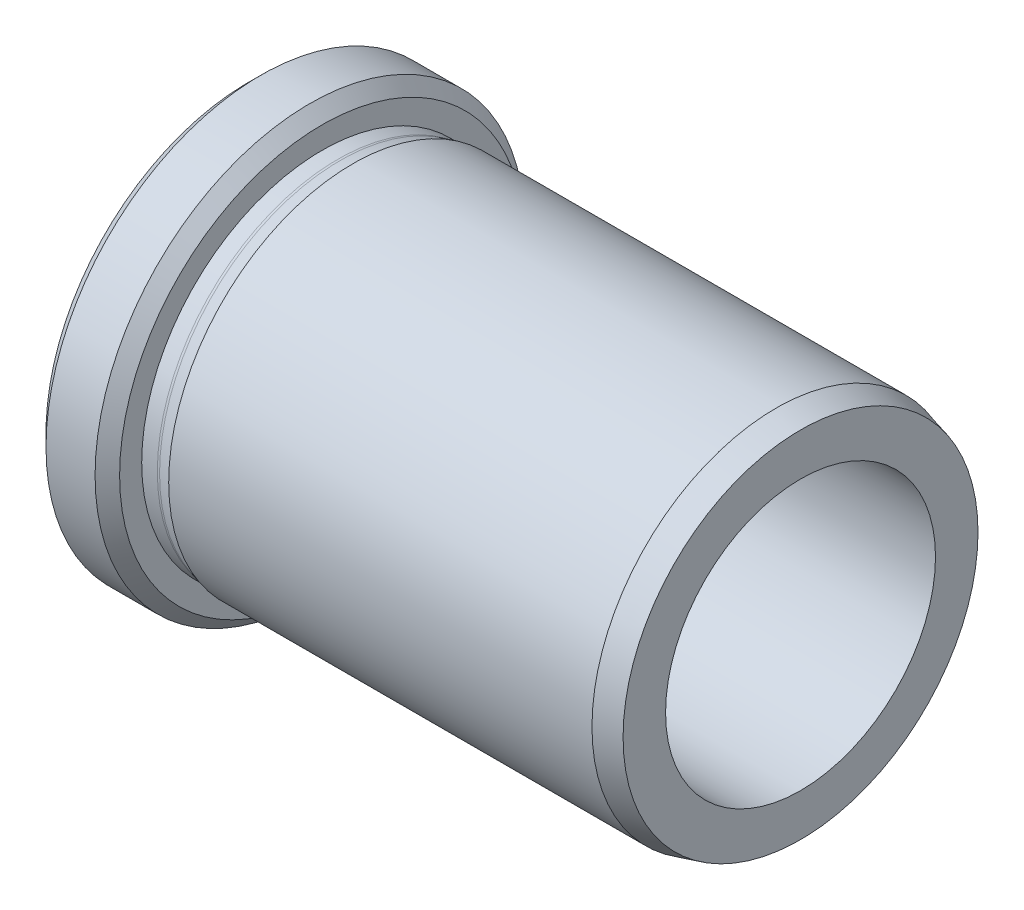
ISO-10303-21;
HEADER;
FILE_DESCRIPTION(('STEP AP214'),'2;1');
FILE_NAME('part.step','',(''),(''),'','','');
FILE_SCHEMA(('AUTOMOTIVE_DESIGN { 1 0 10303 214 1 1 1 1 }'));
ENDSEC;
DATA;
#1=APPLICATION_CONTEXT('core data for automotive mechanical design processes');
#2=APPLICATION_PROTOCOL_DEFINITION('international standard','automotive_design',2000,#1);
#3=PRODUCT_CONTEXT('',#1,'mechanical');
#4=PRODUCT('Part','Part','',(#3));
#5=PRODUCT_RELATED_PRODUCT_CATEGORY('part','',(#4));
#6=PRODUCT_DEFINITION_FORMATION('','',#4);
#7=PRODUCT_DEFINITION_CONTEXT('part definition',#1,'design');
#8=PRODUCT_DEFINITION('design','',#6,#7);
#9=PRODUCT_DEFINITION_SHAPE('','',#8);
#10=(LENGTH_UNIT() NAMED_UNIT(*) SI_UNIT(.MILLI.,.METRE.));
#11=(NAMED_UNIT(*) PLANE_ANGLE_UNIT() SI_UNIT($,.RADIAN.));
#12=(NAMED_UNIT(*) SI_UNIT($,.STERADIAN.) SOLID_ANGLE_UNIT());
#13=UNCERTAINTY_MEASURE_WITH_UNIT(LENGTH_MEASURE(1.E-05),#10,'distance_accuracy_value','');
#14=(GEOMETRIC_REPRESENTATION_CONTEXT(3) GLOBAL_UNCERTAINTY_ASSIGNED_CONTEXT((#13)) GLOBAL_UNIT_ASSIGNED_CONTEXT((#10,
#11,#12)) REPRESENTATION_CONTEXT('',''));
#15=CARTESIAN_POINT('',(0.,0.,0.));
#16=DIRECTION('',(0.,0.,1.));
#17=DIRECTION('',(1.,0.,0.));
#18=AXIS2_PLACEMENT_3D('',#15,#16,#17);
#19=CARTESIAN_POINT('',(18.075539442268,0.,0.));
#20=DIRECTION('',(-1.,0.,0.));
#21=DIRECTION('',(0.,0.,1.));
#22=AXIS2_PLACEMENT_3D('',#19,#20,#21);
#23=TOROIDAL_SURFACE('',#22,15.5,0.8);
#24=CARTESIAN_POINT('',(18.075539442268,0.,0.));
#25=DIRECTION('',(-1.,0.,0.));
#26=DIRECTION('',(0.,0.,1.));
#27=AXIS2_PLACEMENT_3D('',#24,#25,#26);
#28=CIRCLE('',#27,14.7);
#29=CARTESIAN_POINT('',(18.075539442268,0.,14.7));
#30=VERTEX_POINT('',#29);
#31=EDGE_CURVE('E58',#30,#30,#28,.T.);
#32=ORIENTED_EDGE('',*,*,#31,.F.);
#33=EDGE_LOOP('',(#32));
#34=FACE_BOUND('',#33,.T.);
#35=CARTESIAN_POINT('',(18.28259467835,0.,0.));
#36=DIRECTION('',(-1.,0.,0.));
#37=DIRECTION('',(0.,0.,1.));
#38=AXIS2_PLACEMENT_3D('',#35,#36,#37);
#39=CIRCLE('',#38,14.7272593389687);
#40=CARTESIAN_POINT('',(18.28259467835,0.,14.7272593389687));
#41=VERTEX_POINT('',#40);
#42=EDGE_CURVE('E40',#41,#41,#39,.T.);
#43=ORIENTED_EDGE('',*,*,#42,.T.);
#44=EDGE_LOOP('',(#43));
#45=FACE_BOUND('',#44,.T.);
#46=ADVANCED_FACE('F14',(#34,#45),#23,.F.);
#47=CARTESIAN_POINT('',(19.3004766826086,0.,0.));
#48=DIRECTION('',(1.,0.,0.));
#49=DIRECTION('',(0.,0.,-1.));
#50=AXIS2_PLACEMENT_3D('',#47,#48,#49);
#51=CONICAL_SURFACE('',#50,15.,0.261799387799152);
#52=ORIENTED_EDGE('',*,*,#42,.F.);
#53=EDGE_LOOP('',(#52));
#54=FACE_BOUND('',#53,.T.);
#55=CARTESIAN_POINT('',(19.3004766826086,0.,0.));
#56=DIRECTION('',(-1.,0.,0.));
#57=DIRECTION('',(0.,0.,1.));
#58=AXIS2_PLACEMENT_3D('',#55,#56,#57);
#59=CIRCLE('',#58,15.);
#60=CARTESIAN_POINT('',(19.3004766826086,0.,15.));
#61=VERTEX_POINT('',#60);
#62=EDGE_CURVE('E43',#61,#61,#59,.T.);
#63=ORIENTED_EDGE('',*,*,#62,.T.);
#64=EDGE_LOOP('',(#63));
#65=FACE_BOUND('',#64,.T.);
#66=ADVANCED_FACE('F66',(#54,#65),#51,.T.);
#67=CARTESIAN_POINT('',(0.,0.,0.));
#68=DIRECTION('',(-1.,0.,0.));
#69=DIRECTION('',(0.,0.,1.));
#70=AXIS2_PLACEMENT_3D('',#67,#68,#69);
#71=CYLINDRICAL_SURFACE('',#70,15.);
#72=ORIENTED_EDGE('',*,*,#62,.F.);
#73=EDGE_LOOP('',(#72));
#74=FACE_BOUND('',#73,.T.);
#75=CARTESIAN_POINT('',(53.8004766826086,0.,0.));
#76=DIRECTION('',(-1.,0.,0.));
#77=DIRECTION('',(0.,0.,1.));
#78=AXIS2_PLACEMENT_3D('',#75,#76,#77);
#79=CIRCLE('',#78,15.);
#80=CARTESIAN_POINT('',(53.8004766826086,0.,15.));
#81=VERTEX_POINT('',#80);
#82=EDGE_CURVE('E46',#81,#81,#79,.T.);
#83=ORIENTED_EDGE('',*,*,#82,.T.);
#84=EDGE_LOOP('',(#83));
#85=FACE_BOUND('',#84,.T.);
#86=ADVANCED_FACE('F72',(#74,#85),#71,.T.);
#87=CARTESIAN_POINT('',(55.8004766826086,0.,0.));
#88=DIRECTION('',(-1.,0.,0.));
#89=DIRECTION('',(0.,0.,1.));
#90=AXIS2_PLACEMENT_3D('',#87,#88,#89);
#91=CONICAL_SURFACE('',#90,14.4641016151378,0.261799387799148);
#92=ORIENTED_EDGE('',*,*,#82,.F.);
#93=EDGE_LOOP('',(#92));
#94=FACE_BOUND('',#93,.T.);
#95=CARTESIAN_POINT('',(55.8004766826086,0.,0.));
#96=DIRECTION('',(-1.,0.,0.));
#97=DIRECTION('',(0.,0.,1.));
#98=AXIS2_PLACEMENT_3D('',#95,#96,#97);
#99=CIRCLE('',#98,14.4641016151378);
#100=CARTESIAN_POINT('',(55.8004766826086,0.,14.4641016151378));
#101=VERTEX_POINT('',#100);
#102=EDGE_CURVE('E49',#101,#101,#99,.T.);
#103=ORIENTED_EDGE('',*,*,#102,.T.);
#104=EDGE_LOOP('',(#103));
#105=FACE_BOUND('',#104,.T.);
#106=ADVANCED_FACE('F78',(#94,#105),#91,.T.);
#107=CARTESIAN_POINT('',(55.8004766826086,14.4641016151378,0.));
#108=DIRECTION('',(-1.,0.,0.));
#109=DIRECTION('',(0.,0.,1.));
#110=AXIS2_PLACEMENT_3D('',#107,#108,#109);
#111=PLANE('',#110);
#112=ORIENTED_EDGE('',*,*,#102,.F.);
#113=EDGE_LOOP('',(#112));
#114=FACE_BOUND('',#113,.T.);
#115=CARTESIAN_POINT('',(55.8004766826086,0.,0.));
#116=DIRECTION('',(-1.,0.,0.));
#117=DIRECTION('',(0.,0.,1.));
#118=AXIS2_PLACEMENT_3D('',#115,#116,#117);
#119=CIRCLE('',#118,11.);
#120=CARTESIAN_POINT('',(55.8004766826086,0.,11.));
#121=VERTEX_POINT('',#120);
#122=EDGE_CURVE('E52',#121,#121,#119,.T.);
#123=ORIENTED_EDGE('',*,*,#122,.T.);
#124=EDGE_LOOP('',(#123));
#125=FACE_BOUND('',#124,.T.);
#126=ADVANCED_FACE('F84',(#114,#125),#111,.F.);
#127=CARTESIAN_POINT('',(0.,0.,0.));
#128=DIRECTION('',(-1.,0.,0.));
#129=DIRECTION('',(0.,0.,1.));
#130=AXIS2_PLACEMENT_3D('',#127,#128,#129);
#131=CYLINDRICAL_SURFACE('',#130,11.);
#132=CARTESIAN_POINT('',(12.3004766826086,0.,0.));
#133=DIRECTION('',(1.,0.,0.));
#134=DIRECTION('',(0.,0.,-1.));
#135=AXIS2_PLACEMENT_3D('',#132,#133,#134);
#136=CIRCLE('',#135,11.);
#137=CARTESIAN_POINT('',(12.3004766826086,0.,-11.));
#138=VERTEX_POINT('',#137);
#139=EDGE_CURVE('E29',#138,#138,#136,.F.);
#140=ORIENTED_EDGE('',*,*,#139,.T.);
#141=EDGE_LOOP('',(#140));
#142=FACE_BOUND('',#141,.T.);
#143=ORIENTED_EDGE('',*,*,#122,.F.);
#144=EDGE_LOOP('',(#143));
#145=FACE_BOUND('',#144,.T.);
#146=ADVANCED_FACE('F90',(#142,#145),#131,.F.);
#147=CARTESIAN_POINT('',(10.8004766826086,17.5,0.));
#148=DIRECTION('',(1.,0.,0.));
#149=DIRECTION('',(0.,0.,-1.));
#150=AXIS2_PLACEMENT_3D('',#147,#148,#149);
#151=PLANE('',#150);
#152=CARTESIAN_POINT('',(10.8004766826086,0.,0.));
#153=DIRECTION('',(1.,0.,0.));
#154=DIRECTION('',(0.,0.,-1.));
#155=AXIS2_PLACEMENT_3D('',#152,#153,#154);
#156=CIRCLE('',#155,12.5);
#157=CARTESIAN_POINT('',(10.8004766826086,0.,-12.5));
#158=VERTEX_POINT('',#157);
#159=EDGE_CURVE('E25',#158,#158,#156,.T.);
#160=ORIENTED_EDGE('',*,*,#159,.T.);
#161=EDGE_LOOP('',(#160));
#162=FACE_BOUND('',#161,.T.);
#163=CARTESIAN_POINT('',(10.8004766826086,0.,0.));
#164=DIRECTION('',(1.,0.,0.));
#165=DIRECTION('',(0.,0.,-1.));
#166=AXIS2_PLACEMENT_3D('',#163,#164,#165);
#167=CIRCLE('',#166,16.5);
#168=CARTESIAN_POINT('',(10.8004766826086,0.,-16.5));
#169=VERTEX_POINT('',#168);
#170=EDGE_CURVE('E37',#169,#169,#167,.F.);
#171=ORIENTED_EDGE('',*,*,#170,.T.);
#172=EDGE_LOOP('',(#171));
#173=FACE_BOUND('',#172,.T.);
#174=ADVANCED_FACE('F95',(#162,#173),#151,.F.);
#175=CARTESIAN_POINT('',(0.,0.,0.));
#176=DIRECTION('',(-1.,0.,0.));
#177=DIRECTION('',(0.,0.,1.));
#178=AXIS2_PLACEMENT_3D('',#175,#176,#177);
#179=CYLINDRICAL_SURFACE('',#178,17.5);
#180=CARTESIAN_POINT('',(15.8004766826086,0.,0.));
#181=DIRECTION('',(-1.,0.,0.));
#182=DIRECTION('',(0.,0.,1.));
#183=AXIS2_PLACEMENT_3D('',#180,#181,#182);
#184=CIRCLE('',#183,17.5);
#185=CARTESIAN_POINT('',(15.8004766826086,0.,17.5));
#186=VERTEX_POINT('',#185);
#187=EDGE_CURVE('E21',#186,#186,#184,.T.);
#188=ORIENTED_EDGE('',*,*,#187,.T.);
#189=EDGE_LOOP('',(#188));
#190=FACE_BOUND('',#189,.T.);
#191=CARTESIAN_POINT('',(11.8004766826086,0.,0.));
#192=DIRECTION('',(1.,0.,0.));
#193=DIRECTION('',(0.,0.,-1.));
#194=AXIS2_PLACEMENT_3D('',#191,#192,#193);
#195=CIRCLE('',#194,17.5);
#196=CARTESIAN_POINT('',(11.8004766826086,0.,-17.5));
#197=VERTEX_POINT('',#196);
#198=EDGE_CURVE('E34',#197,#197,#195,.T.);
#199=ORIENTED_EDGE('',*,*,#198,.T.);
#200=EDGE_LOOP('',(#199));
#201=FACE_BOUND('',#200,.T.);
#202=ADVANCED_FACE('F103',(#190,#201),#179,.T.);
#203=CARTESIAN_POINT('',(16.8004766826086,17.5,0.));
#204=DIRECTION('',(-1.,0.,0.));
#205=DIRECTION('',(0.,0.,1.));
#206=AXIS2_PLACEMENT_3D('',#203,#204,#205);
#207=PLANE('',#206);
#208=CARTESIAN_POINT('',(16.8004766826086,0.,0.));
#209=DIRECTION('',(-1.,0.,0.));
#210=DIRECTION('',(0.,0.,1.));
#211=AXIS2_PLACEMENT_3D('',#208,#209,#210);
#212=CIRCLE('',#211,16.5);
#213=CARTESIAN_POINT('',(16.8004766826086,0.,16.5));
#214=VERTEX_POINT('',#213);
#215=EDGE_CURVE('E9',#214,#214,#212,.F.);
#216=ORIENTED_EDGE('',*,*,#215,.T.);
#217=EDGE_LOOP('',(#216));
#218=FACE_BOUND('',#217,.T.);
#219=CARTESIAN_POINT('',(16.8004766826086,0.,0.));
#220=DIRECTION('',(-1.,0.,0.));
#221=DIRECTION('',(0.,0.,1.));
#222=AXIS2_PLACEMENT_3D('',#219,#220,#221);
#223=CIRCLE('',#222,14.7);
#224=CARTESIAN_POINT('',(16.8004766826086,0.,14.7));
#225=VERTEX_POINT('',#224);
#226=EDGE_CURVE('E55',#225,#225,#223,.T.);
#227=ORIENTED_EDGE('',*,*,#226,.T.);
#228=EDGE_LOOP('',(#227));
#229=FACE_BOUND('',#228,.T.);
#230=ADVANCED_FACE('F142',(#218,#229),#207,.F.);
#231=CARTESIAN_POINT('',(0.,0.,0.));
#232=DIRECTION('',(-1.,0.,0.));
#233=DIRECTION('',(0.,0.,1.));
#234=AXIS2_PLACEMENT_3D('',#231,#232,#233);
#235=CYLINDRICAL_SURFACE('',#234,14.7);
#236=ORIENTED_EDGE('',*,*,#226,.F.);
#237=EDGE_LOOP('',(#236));
#238=FACE_BOUND('',#237,.T.);
#239=ORIENTED_EDGE('',*,*,#31,.T.);
#240=EDGE_LOOP('',(#239));
#241=FACE_BOUND('',#240,.T.);
#242=ADVANCED_FACE('F62',(#238,#241),#235,.T.);
#243=CARTESIAN_POINT('',(10.8004766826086,0.,0.));
#244=DIRECTION('',(1.,0.,0.));
#245=DIRECTION('',(0.,0.,-1.));
#246=AXIS2_PLACEMENT_3D('',#243,#244,#245);
#247=CONICAL_SURFACE('',#246,16.5,0.785398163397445);
#248=ORIENTED_EDGE('',*,*,#198,.F.);
#249=EDGE_LOOP('',(#248));
#250=FACE_BOUND('',#249,.T.);
#251=ORIENTED_EDGE('',*,*,#170,.F.);
#252=EDGE_LOOP('',(#251));
#253=FACE_BOUND('',#252,.T.);
#254=ADVANCED_FACE('F108',(#250,#253),#247,.T.);
#255=CARTESIAN_POINT('',(12.3004766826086,0.,0.));
#256=DIRECTION('',(1.,0.,0.));
#257=DIRECTION('',(0.,0.,-1.));
#258=AXIS2_PLACEMENT_3D('',#255,#256,#257);
#259=TOROIDAL_SURFACE('',#258,12.5,1.5);
#260=ORIENTED_EDGE('',*,*,#159,.F.);
#261=EDGE_LOOP('',(#260));
#262=FACE_BOUND('',#261,.T.);
#263=ORIENTED_EDGE('',*,*,#139,.F.);
#264=EDGE_LOOP('',(#263));
#265=FACE_BOUND('',#264,.T.);
#266=ADVANCED_FACE('F110',(#262,#265),#259,.T.);
#267=CARTESIAN_POINT('',(15.8004766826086,0.,0.));
#268=DIRECTION('',(-1.,0.,0.));
#269=DIRECTION('',(0.,0.,1.));
#270=AXIS2_PLACEMENT_3D('',#267,#268,#269);
#271=CONICAL_SURFACE('',#270,17.5,0.78539816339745);
#272=ORIENTED_EDGE('',*,*,#215,.F.);
#273=EDGE_LOOP('',(#272));
#274=FACE_BOUND('',#273,.T.);
#275=ORIENTED_EDGE('',*,*,#187,.F.);
#276=EDGE_LOOP('',(#275));
#277=FACE_BOUND('',#276,.T.);
#278=ADVANCED_FACE('F16',(#274,#277),#271,.T.);
#279=CLOSED_SHELL('',(#46,#66,#86,#106,#126,#146,#174,#202,#230,#242,#254,#266,#278));
#280=MANIFOLD_SOLID_BREP('B1',#279);
#281=ADVANCED_BREP_SHAPE_REPRESENTATION('',(#18,#280),#14);
#282=SHAPE_DEFINITION_REPRESENTATION(#9,#281);
ENDSEC;
END-ISO-10303-21;
